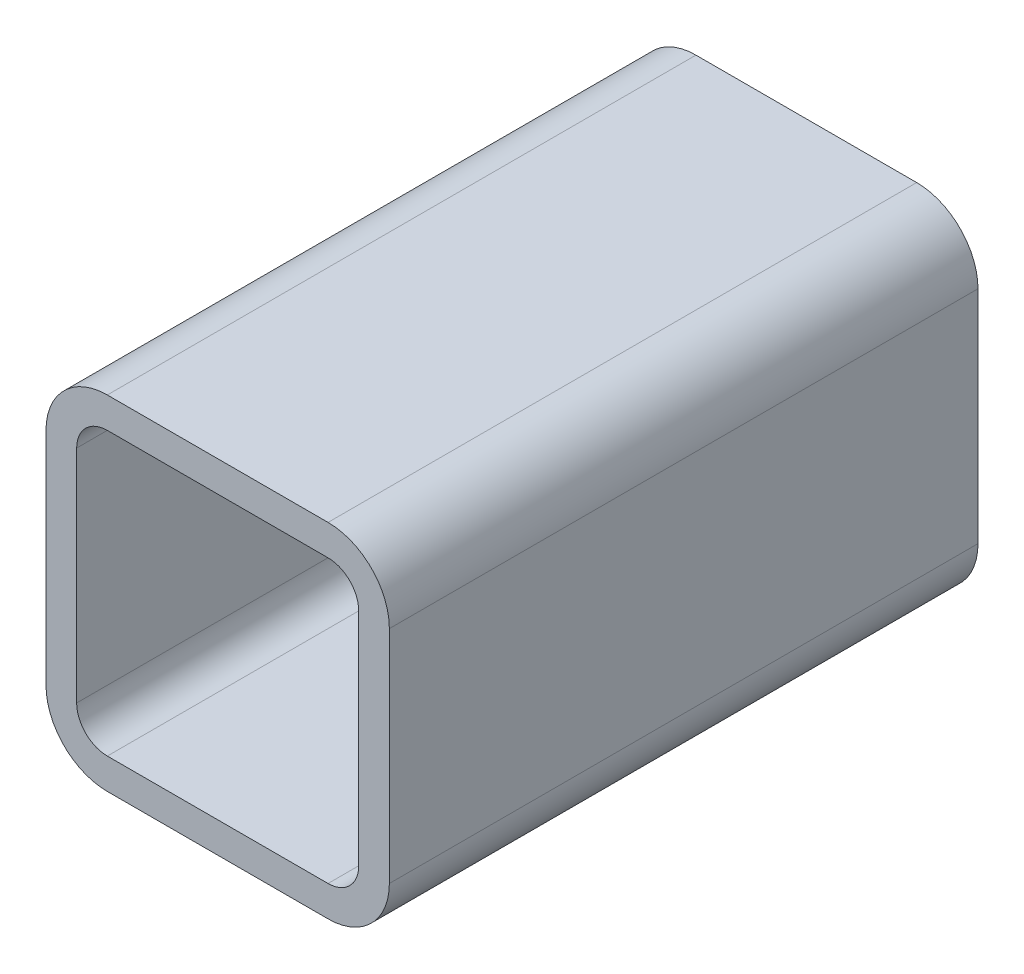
ISO-10303-21;
HEADER;
FILE_DESCRIPTION(('STEP AP214'),'2;1');
FILE_NAME('part.step','',(''),(''),'','','');
FILE_SCHEMA(('AUTOMOTIVE_DESIGN { 1 0 10303 214 1 1 1 1 }'));
ENDSEC;
DATA;
#1=APPLICATION_CONTEXT('core data for automotive mechanical design processes');
#2=APPLICATION_PROTOCOL_DEFINITION('international standard','automotive_design',2000,#1);
#3=PRODUCT_CONTEXT('',#1,'mechanical');
#4=PRODUCT('Part','Part','',(#3));
#5=PRODUCT_RELATED_PRODUCT_CATEGORY('part','',(#4));
#6=PRODUCT_DEFINITION_FORMATION('','',#4);
#7=PRODUCT_DEFINITION_CONTEXT('part definition',#1,'design');
#8=PRODUCT_DEFINITION('design','',#6,#7);
#9=PRODUCT_DEFINITION_SHAPE('','',#8);
#10=(LENGTH_UNIT() NAMED_UNIT(*) SI_UNIT(.MILLI.,.METRE.));
#11=(NAMED_UNIT(*) PLANE_ANGLE_UNIT() SI_UNIT($,.RADIAN.));
#12=(NAMED_UNIT(*) SI_UNIT($,.STERADIAN.) SOLID_ANGLE_UNIT());
#13=UNCERTAINTY_MEASURE_WITH_UNIT(LENGTH_MEASURE(1.E-05),#10,'distance_accuracy_value','');
#14=(GEOMETRIC_REPRESENTATION_CONTEXT(3) GLOBAL_UNCERTAINTY_ASSIGNED_CONTEXT((#13)) GLOBAL_UNIT_ASSIGNED_CONTEXT((#10,
#11,#12)) REPRESENTATION_CONTEXT('',''));
#15=CARTESIAN_POINT('',(0.,0.,0.));
#16=DIRECTION('',(0.,0.,1.));
#17=DIRECTION('',(1.,0.,0.));
#18=AXIS2_PLACEMENT_3D('',#15,#16,#17);
#19=CARTESIAN_POINT('',(33.9548786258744,148.039039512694,304.8));
#20=DIRECTION('',(0.,0.,1.));
#21=DIRECTION('',(1.,0.,0.));
#22=AXIS2_PLACEMENT_3D('',#19,#20,#21);
#23=PLANE('',#22);
#24=CARTESIAN_POINT('',(33.9548786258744,148.039039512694,304.8));
#25=DIRECTION('',(0.,0.,1.));
#26=DIRECTION('',(1.,0.,0.));
#27=AXIS2_PLACEMENT_3D('',#24,#25,#26);
#28=CIRCLE('',#27,31.75);
#29=CARTESIAN_POINT('',(33.9548786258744,179.789039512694,304.8));
#30=VERTEX_POINT('',#29);
#31=CARTESIAN_POINT('',(2.20487862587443,148.039039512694,304.8));
#32=VERTEX_POINT('',#31);
#33=EDGE_CURVE('E211',#30,#32,#28,.T.);
#34=ORIENTED_EDGE('',*,*,#33,.T.);
#35=DIRECTION('',(0.,-1.,0.));
#36=VECTOR('',#35,1.);
#37=CARTESIAN_POINT('',(2.20487862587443,33.7390395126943,304.8));
#38=LINE('',#37,#36);
#39=CARTESIAN_POINT('',(2.20487862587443,33.7390395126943,304.8));
#40=VERTEX_POINT('',#39);
#41=EDGE_CURVE('E214',#32,#40,#38,.T.);
#42=ORIENTED_EDGE('',*,*,#41,.T.);
#43=CARTESIAN_POINT('',(33.9548786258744,33.7390395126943,304.8));
#44=DIRECTION('',(0.,0.,1.));
#45=DIRECTION('',(1.,0.,0.));
#46=AXIS2_PLACEMENT_3D('',#43,#44,#45);
#47=CIRCLE('',#46,31.75);
#48=CARTESIAN_POINT('',(33.9548786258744,1.98903951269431,304.8));
#49=VERTEX_POINT('',#48);
#50=EDGE_CURVE('E217',#40,#49,#47,.T.);
#51=ORIENTED_EDGE('',*,*,#50,.T.);
#52=DIRECTION('',(1.,0.,0.));
#53=VECTOR('',#52,1.);
#54=CARTESIAN_POINT('',(148.254878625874,1.98903951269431,304.8));
#55=LINE('',#54,#53);
#56=CARTESIAN_POINT('',(148.254878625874,1.9890395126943,304.8));
#57=VERTEX_POINT('',#56);
#58=EDGE_CURVE('E219',#49,#57,#55,.T.);
#59=ORIENTED_EDGE('',*,*,#58,.T.);
#60=CARTESIAN_POINT('',(148.254878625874,33.7390395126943,304.8));
#61=DIRECTION('',(0.,0.,1.));
#62=DIRECTION('',(1.,0.,0.));
#63=AXIS2_PLACEMENT_3D('',#60,#61,#62);
#64=CIRCLE('',#63,31.75);
#65=CARTESIAN_POINT('',(180.004878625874,33.7390395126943,304.8));
#66=VERTEX_POINT('',#65);
#67=EDGE_CURVE('E221',#57,#66,#64,.T.);
#68=ORIENTED_EDGE('',*,*,#67,.T.);
#69=DIRECTION('',(0.,1.,0.));
#70=VECTOR('',#69,1.);
#71=CARTESIAN_POINT('',(180.004878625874,148.039039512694,304.8));
#72=LINE('',#71,#70);
#73=CARTESIAN_POINT('',(180.004878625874,148.039039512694,304.8));
#74=VERTEX_POINT('',#73);
#75=EDGE_CURVE('E223',#66,#74,#72,.T.);
#76=ORIENTED_EDGE('',*,*,#75,.T.);
#77=CARTESIAN_POINT('',(148.254878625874,148.039039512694,304.8));
#78=DIRECTION('',(0.,0.,1.));
#79=DIRECTION('',(1.,0.,0.));
#80=AXIS2_PLACEMENT_3D('',#77,#78,#79);
#81=CIRCLE('',#80,31.75);
#82=CARTESIAN_POINT('',(148.254878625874,179.789039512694,304.8));
#83=VERTEX_POINT('',#82);
#84=EDGE_CURVE('E225',#74,#83,#81,.T.);
#85=ORIENTED_EDGE('',*,*,#84,.T.);
#86=DIRECTION('',(-1.,0.,0.));
#87=VECTOR('',#86,1.);
#88=CARTESIAN_POINT('',(33.9548786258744,179.789039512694,304.8));
#89=LINE('',#88,#87);
#90=EDGE_CURVE('E227',#83,#30,#89,.T.);
#91=ORIENTED_EDGE('',*,*,#90,.T.);
#92=EDGE_LOOP('',(#34,#42,#51,#59,#68,#76,#85,#91));
#93=FACE_BOUND('',#92,.T.);
#94=DIRECTION('',(0.,-1.,0.));
#95=VECTOR('',#94,1.);
#96=CARTESIAN_POINT('',(18.0798786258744,33.7390395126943,304.8));
#97=LINE('',#96,#95);
#98=CARTESIAN_POINT('',(18.0798786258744,148.039039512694,304.8));
#99=VERTEX_POINT('',#98);
#100=CARTESIAN_POINT('',(18.0798786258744,33.7390395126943,304.8));
#101=VERTEX_POINT('',#100);
#102=EDGE_CURVE('E154',#99,#101,#97,.T.);
#103=ORIENTED_EDGE('',*,*,#102,.F.);
#104=CARTESIAN_POINT('',(33.9548786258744,148.039039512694,304.8));
#105=DIRECTION('',(0.,0.,1.));
#106=DIRECTION('',(1.,0.,0.));
#107=AXIS2_PLACEMENT_3D('',#104,#105,#106);
#108=CIRCLE('',#107,15.875);
#109=CARTESIAN_POINT('',(33.9548786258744,163.914039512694,304.8));
#110=VERTEX_POINT('',#109);
#111=EDGE_CURVE('E146',#110,#99,#108,.T.);
#112=ORIENTED_EDGE('',*,*,#111,.F.);
#113=DIRECTION('',(-1.,0.,0.));
#114=VECTOR('',#113,1.);
#115=CARTESIAN_POINT('',(33.9548786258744,163.914039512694,304.8));
#116=LINE('',#115,#114);
#117=CARTESIAN_POINT('',(148.254878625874,163.914039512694,304.8));
#118=VERTEX_POINT('',#117);
#119=EDGE_CURVE('E179',#118,#110,#116,.T.);
#120=ORIENTED_EDGE('',*,*,#119,.F.);
#121=CARTESIAN_POINT('',(148.254878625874,148.039039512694,304.8));
#122=DIRECTION('',(0.,0.,1.));
#123=DIRECTION('',(1.,0.,0.));
#124=AXIS2_PLACEMENT_3D('',#121,#122,#123);
#125=CIRCLE('',#124,15.875);
#126=CARTESIAN_POINT('',(164.129878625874,148.039039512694,304.8));
#127=VERTEX_POINT('',#126);
#128=EDGE_CURVE('E177',#127,#118,#125,.T.);
#129=ORIENTED_EDGE('',*,*,#128,.F.);
#130=DIRECTION('',(0.,1.,0.));
#131=VECTOR('',#130,1.);
#132=CARTESIAN_POINT('',(164.129878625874,148.039039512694,304.8));
#133=LINE('',#132,#131);
#134=CARTESIAN_POINT('',(164.129878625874,33.7390395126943,304.8));
#135=VERTEX_POINT('',#134);
#136=EDGE_CURVE('E175',#135,#127,#133,.T.);
#137=ORIENTED_EDGE('',*,*,#136,.F.);
#138=CARTESIAN_POINT('',(148.254878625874,33.7390395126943,304.8));
#139=DIRECTION('',(0.,0.,1.));
#140=DIRECTION('',(1.,0.,0.));
#141=AXIS2_PLACEMENT_3D('',#138,#139,#140);
#142=CIRCLE('',#141,15.875);
#143=CARTESIAN_POINT('',(148.254878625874,17.8640395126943,304.8));
#144=VERTEX_POINT('',#143);
#145=EDGE_CURVE('E173',#144,#135,#142,.T.);
#146=ORIENTED_EDGE('',*,*,#145,.F.);
#147=DIRECTION('',(1.,0.,0.));
#148=VECTOR('',#147,1.);
#149=CARTESIAN_POINT('',(148.254878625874,17.8640395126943,304.8));
#150=LINE('',#149,#148);
#151=CARTESIAN_POINT('',(33.9548786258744,17.8640395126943,304.8));
#152=VERTEX_POINT('',#151);
#153=EDGE_CURVE('E169',#152,#144,#150,.T.);
#154=ORIENTED_EDGE('',*,*,#153,.F.);
#155=CARTESIAN_POINT('',(33.9548786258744,33.7390395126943,304.8));
#156=DIRECTION('',(0.,0.,1.));
#157=DIRECTION('',(1.,0.,0.));
#158=AXIS2_PLACEMENT_3D('',#155,#156,#157);
#159=CIRCLE('',#158,15.875);
#160=EDGE_CURVE('E167',#101,#152,#159,.T.);
#161=ORIENTED_EDGE('',*,*,#160,.F.);
#162=EDGE_LOOP('',(#103,#112,#120,#129,#137,#146,#154,#161));
#163=FACE_BOUND('',#162,.T.);
#164=ADVANCED_FACE('F33',(#93,#163),#23,.T.);
#165=CARTESIAN_POINT('',(33.9548786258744,148.039039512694,0.));
#166=DIRECTION('',(0.,0.,1.));
#167=DIRECTION('',(1.,0.,0.));
#168=AXIS2_PLACEMENT_3D('',#165,#166,#167);
#169=PLANE('',#168);
#170=CARTESIAN_POINT('',(33.9548786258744,148.039039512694,0.));
#171=DIRECTION('',(0.,0.,1.));
#172=DIRECTION('',(1.,0.,0.));
#173=AXIS2_PLACEMENT_3D('',#170,#171,#172);
#174=CIRCLE('',#173,31.75);
#175=CARTESIAN_POINT('',(33.9548786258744,179.789039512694,0.));
#176=VERTEX_POINT('',#175);
#177=CARTESIAN_POINT('',(2.20487862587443,148.039039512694,0.));
#178=VERTEX_POINT('',#177);
#179=EDGE_CURVE('E162',#176,#178,#174,.T.);
#180=ORIENTED_EDGE('',*,*,#179,.F.);
#181=DIRECTION('',(-1.,0.,0.));
#182=VECTOR('',#181,1.);
#183=CARTESIAN_POINT('',(33.9548786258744,179.789039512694,0.));
#184=LINE('',#183,#182);
#185=CARTESIAN_POINT('',(148.254878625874,179.789039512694,0.));
#186=VERTEX_POINT('',#185);
#187=EDGE_CURVE('E215',#186,#176,#184,.T.);
#188=ORIENTED_EDGE('',*,*,#187,.F.);
#189=CARTESIAN_POINT('',(148.254878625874,148.039039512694,0.));
#190=DIRECTION('',(0.,0.,1.));
#191=DIRECTION('',(1.,0.,0.));
#192=AXIS2_PLACEMENT_3D('',#189,#190,#191);
#193=CIRCLE('',#192,31.75);
#194=CARTESIAN_POINT('',(180.004878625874,148.039039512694,0.));
#195=VERTEX_POINT('',#194);
#196=EDGE_CURVE('E242',#195,#186,#193,.T.);
#197=ORIENTED_EDGE('',*,*,#196,.F.);
#198=DIRECTION('',(0.,1.,0.));
#199=VECTOR('',#198,1.);
#200=CARTESIAN_POINT('',(180.004878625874,148.039039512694,0.));
#201=LINE('',#200,#199);
#202=CARTESIAN_POINT('',(180.004878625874,33.7390395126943,0.));
#203=VERTEX_POINT('',#202);
#204=EDGE_CURVE('E240',#203,#195,#201,.T.);
#205=ORIENTED_EDGE('',*,*,#204,.F.);
#206=CARTESIAN_POINT('',(148.254878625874,33.7390395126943,0.));
#207=DIRECTION('',(0.,0.,1.));
#208=DIRECTION('',(1.,0.,0.));
#209=AXIS2_PLACEMENT_3D('',#206,#207,#208);
#210=CIRCLE('',#209,31.75);
#211=CARTESIAN_POINT('',(148.254878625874,1.9890395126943,0.));
#212=VERTEX_POINT('',#211);
#213=EDGE_CURVE('E238',#212,#203,#210,.T.);
#214=ORIENTED_EDGE('',*,*,#213,.F.);
#215=DIRECTION('',(1.,0.,0.));
#216=VECTOR('',#215,1.);
#217=CARTESIAN_POINT('',(148.254878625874,1.98903951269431,0.));
#218=LINE('',#217,#216);
#219=CARTESIAN_POINT('',(33.9548786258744,1.98903951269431,0.));
#220=VERTEX_POINT('',#219);
#221=EDGE_CURVE('E236',#220,#212,#218,.T.);
#222=ORIENTED_EDGE('',*,*,#221,.F.);
#223=CARTESIAN_POINT('',(33.9548786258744,33.7390395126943,0.));
#224=DIRECTION('',(0.,0.,1.));
#225=DIRECTION('',(1.,0.,0.));
#226=AXIS2_PLACEMENT_3D('',#223,#224,#225);
#227=CIRCLE('',#226,31.75);
#228=CARTESIAN_POINT('',(2.20487862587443,33.7390395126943,0.));
#229=VERTEX_POINT('',#228);
#230=EDGE_CURVE('E234',#229,#220,#227,.T.);
#231=ORIENTED_EDGE('',*,*,#230,.F.);
#232=DIRECTION('',(0.,-1.,0.));
#233=VECTOR('',#232,1.);
#234=CARTESIAN_POINT('',(2.20487862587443,33.7390395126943,0.));
#235=LINE('',#234,#233);
#236=EDGE_CURVE('E232',#178,#229,#235,.T.);
#237=ORIENTED_EDGE('',*,*,#236,.F.);
#238=EDGE_LOOP('',(#180,#188,#197,#205,#214,#222,#231,#237));
#239=FACE_BOUND('',#238,.T.);
#240=CARTESIAN_POINT('',(33.9548786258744,148.039039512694,0.));
#241=DIRECTION('',(0.,0.,1.));
#242=DIRECTION('',(1.,0.,0.));
#243=AXIS2_PLACEMENT_3D('',#240,#241,#242);
#244=CIRCLE('',#243,15.875);
#245=CARTESIAN_POINT('',(33.9548786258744,163.914039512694,0.));
#246=VERTEX_POINT('',#245);
#247=CARTESIAN_POINT('',(18.0798786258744,148.039039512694,0.));
#248=VERTEX_POINT('',#247);
#249=EDGE_CURVE('E56',#246,#248,#244,.T.);
#250=ORIENTED_EDGE('',*,*,#249,.T.);
#251=DIRECTION('',(0.,-1.,0.));
#252=VECTOR('',#251,1.);
#253=CARTESIAN_POINT('',(18.0798786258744,33.7390395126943,0.));
#254=LINE('',#253,#252);
#255=CARTESIAN_POINT('',(18.0798786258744,33.7390395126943,0.));
#256=VERTEX_POINT('',#255);
#257=EDGE_CURVE('E161',#248,#256,#254,.T.);
#258=ORIENTED_EDGE('',*,*,#257,.T.);
#259=CARTESIAN_POINT('',(33.9548786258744,33.7390395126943,0.));
#260=DIRECTION('',(0.,0.,1.));
#261=DIRECTION('',(1.,0.,0.));
#262=AXIS2_PLACEMENT_3D('',#259,#260,#261);
#263=CIRCLE('',#262,15.875);
#264=CARTESIAN_POINT('',(33.9548786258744,17.8640395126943,0.));
#265=VERTEX_POINT('',#264);
#266=EDGE_CURVE('E183',#256,#265,#263,.T.);
#267=ORIENTED_EDGE('',*,*,#266,.T.);
#268=DIRECTION('',(1.,0.,0.));
#269=VECTOR('',#268,1.);
#270=CARTESIAN_POINT('',(148.254878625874,17.8640395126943,0.));
#271=LINE('',#270,#269);
#272=CARTESIAN_POINT('',(148.254878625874,17.8640395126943,0.));
#273=VERTEX_POINT('',#272);
#274=EDGE_CURVE('E186',#265,#273,#271,.T.);
#275=ORIENTED_EDGE('',*,*,#274,.T.);
#276=CARTESIAN_POINT('',(148.254878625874,33.7390395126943,0.));
#277=DIRECTION('',(0.,0.,1.));
#278=DIRECTION('',(1.,0.,0.));
#279=AXIS2_PLACEMENT_3D('',#276,#277,#278);
#280=CIRCLE('',#279,15.875);
#281=CARTESIAN_POINT('',(164.129878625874,33.7390395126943,0.));
#282=VERTEX_POINT('',#281);
#283=EDGE_CURVE('E189',#273,#282,#280,.T.);
#284=ORIENTED_EDGE('',*,*,#283,.T.);
#285=DIRECTION('',(0.,1.,0.));
#286=VECTOR('',#285,1.);
#287=CARTESIAN_POINT('',(164.129878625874,148.039039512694,0.));
#288=LINE('',#287,#286);
#289=CARTESIAN_POINT('',(164.129878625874,148.039039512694,0.));
#290=VERTEX_POINT('',#289);
#291=EDGE_CURVE('E192',#282,#290,#288,.T.);
#292=ORIENTED_EDGE('',*,*,#291,.T.);
#293=CARTESIAN_POINT('',(148.254878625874,148.039039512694,0.));
#294=DIRECTION('',(0.,0.,1.));
#295=DIRECTION('',(1.,0.,0.));
#296=AXIS2_PLACEMENT_3D('',#293,#294,#295);
#297=CIRCLE('',#296,15.875);
#298=CARTESIAN_POINT('',(148.254878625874,163.914039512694,0.));
#299=VERTEX_POINT('',#298);
#300=EDGE_CURVE('E195',#290,#299,#297,.T.);
#301=ORIENTED_EDGE('',*,*,#300,.T.);
#302=DIRECTION('',(-1.,0.,0.));
#303=VECTOR('',#302,1.);
#304=CARTESIAN_POINT('',(33.9548786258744,163.914039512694,0.));
#305=LINE('',#304,#303);
#306=EDGE_CURVE('E155',#299,#246,#305,.T.);
#307=ORIENTED_EDGE('',*,*,#306,.T.);
#308=EDGE_LOOP('',(#250,#258,#267,#275,#284,#292,#301,#307));
#309=FACE_BOUND('',#308,.T.);
#310=ADVANCED_FACE('F272',(#239,#309),#169,.F.);
#311=CARTESIAN_POINT('',(33.9548786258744,148.039039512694,304.8));
#312=DIRECTION('',(0.,0.,-1.));
#313=DIRECTION('',(-1.,0.,0.));
#314=AXIS2_PLACEMENT_3D('',#311,#312,#313);
#315=CYLINDRICAL_SURFACE('',#314,31.75);
#316=ORIENTED_EDGE('',*,*,#179,.T.);
#317=DIRECTION('',(0.,0.,-1.));
#318=VECTOR('',#317,1.);
#319=CARTESIAN_POINT('',(2.20487862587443,148.039039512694,304.8));
#320=LINE('',#319,#318);
#321=EDGE_CURVE('E11',#32,#178,#320,.T.);
#322=ORIENTED_EDGE('',*,*,#321,.F.);
#323=ORIENTED_EDGE('',*,*,#33,.F.);
#324=DIRECTION('',(0.,0.,-1.));
#325=VECTOR('',#324,1.);
#326=CARTESIAN_POINT('',(33.9548786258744,179.789039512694,304.8));
#327=LINE('',#326,#325);
#328=EDGE_CURVE('E229',#30,#176,#327,.T.);
#329=ORIENTED_EDGE('',*,*,#328,.T.);
#330=EDGE_LOOP('',(#316,#322,#323,#329));
#331=FACE_BOUND('',#330,.T.);
#332=ADVANCED_FACE('F35',(#331),#315,.T.);
#333=CARTESIAN_POINT('',(2.20487862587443,33.7390395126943,304.8));
#334=DIRECTION('',(1.,0.,0.));
#335=DIRECTION('',(0.,0.,-1.));
#336=AXIS2_PLACEMENT_3D('',#333,#334,#335);
#337=PLANE('',#336);
#338=ORIENTED_EDGE('',*,*,#236,.T.);
#339=DIRECTION('',(0.,0.,-1.));
#340=VECTOR('',#339,1.);
#341=CARTESIAN_POINT('',(2.20487862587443,33.7390395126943,304.8));
#342=LINE('',#341,#340);
#343=EDGE_CURVE('E41',#40,#229,#342,.T.);
#344=ORIENTED_EDGE('',*,*,#343,.F.);
#345=ORIENTED_EDGE('',*,*,#41,.F.);
#346=ORIENTED_EDGE('',*,*,#321,.T.);
#347=EDGE_LOOP('',(#338,#344,#345,#346));
#348=FACE_BOUND('',#347,.T.);
#349=ADVANCED_FACE('F289',(#348),#337,.F.);
#350=CARTESIAN_POINT('',(33.9548786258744,33.7390395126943,304.8));
#351=DIRECTION('',(0.,0.,-1.));
#352=DIRECTION('',(-1.,0.,0.));
#353=AXIS2_PLACEMENT_3D('',#350,#351,#352);
#354=CYLINDRICAL_SURFACE('',#353,31.75);
#355=ORIENTED_EDGE('',*,*,#230,.T.);
#356=DIRECTION('',(0.,0.,-1.));
#357=VECTOR('',#356,1.);
#358=CARTESIAN_POINT('',(33.9548786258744,1.98903951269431,304.8));
#359=LINE('',#358,#357);
#360=EDGE_CURVE('E259',#49,#220,#359,.T.);
#361=ORIENTED_EDGE('',*,*,#360,.F.);
#362=ORIENTED_EDGE('',*,*,#50,.F.);
#363=ORIENTED_EDGE('',*,*,#343,.T.);
#364=EDGE_LOOP('',(#355,#361,#362,#363));
#365=FACE_BOUND('',#364,.T.);
#366=ADVANCED_FACE('F266',(#365),#354,.T.);
#367=CARTESIAN_POINT('',(148.254878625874,1.98903951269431,304.8));
#368=DIRECTION('',(0.,1.,0.));
#369=DIRECTION('',(0.,0.,1.));
#370=AXIS2_PLACEMENT_3D('',#367,#368,#369);
#371=PLANE('',#370);
#372=ORIENTED_EDGE('',*,*,#221,.T.);
#373=DIRECTION('',(0.,0.,-1.));
#374=VECTOR('',#373,1.);
#375=CARTESIAN_POINT('',(148.254878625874,1.9890395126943,304.8));
#376=LINE('',#375,#374);
#377=EDGE_CURVE('E256',#57,#212,#376,.T.);
#378=ORIENTED_EDGE('',*,*,#377,.F.);
#379=ORIENTED_EDGE('',*,*,#58,.F.);
#380=ORIENTED_EDGE('',*,*,#360,.T.);
#381=EDGE_LOOP('',(#372,#378,#379,#380));
#382=FACE_BOUND('',#381,.T.);
#383=ADVANCED_FACE('F278',(#382),#371,.F.);
#384=CARTESIAN_POINT('',(148.254878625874,33.7390395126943,304.8));
#385=DIRECTION('',(0.,0.,-1.));
#386=DIRECTION('',(-1.,0.,0.));
#387=AXIS2_PLACEMENT_3D('',#384,#385,#386);
#388=CYLINDRICAL_SURFACE('',#387,31.75);
#389=ORIENTED_EDGE('',*,*,#213,.T.);
#390=DIRECTION('',(0.,0.,-1.));
#391=VECTOR('',#390,1.);
#392=CARTESIAN_POINT('',(180.004878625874,33.7390395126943,304.8));
#393=LINE('',#392,#391);
#394=EDGE_CURVE('E253',#66,#203,#393,.T.);
#395=ORIENTED_EDGE('',*,*,#394,.F.);
#396=ORIENTED_EDGE('',*,*,#67,.F.);
#397=ORIENTED_EDGE('',*,*,#377,.T.);
#398=EDGE_LOOP('',(#389,#395,#396,#397));
#399=FACE_BOUND('',#398,.T.);
#400=ADVANCED_FACE('F282',(#399),#388,.T.);
#401=CARTESIAN_POINT('',(180.004878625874,148.039039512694,304.8));
#402=DIRECTION('',(-1.,0.,0.));
#403=DIRECTION('',(0.,0.,1.));
#404=AXIS2_PLACEMENT_3D('',#401,#402,#403);
#405=PLANE('',#404);
#406=ORIENTED_EDGE('',*,*,#204,.T.);
#407=DIRECTION('',(0.,0.,-1.));
#408=VECTOR('',#407,1.);
#409=CARTESIAN_POINT('',(180.004878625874,148.039039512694,304.8));
#410=LINE('',#409,#408);
#411=EDGE_CURVE('E250',#74,#195,#410,.T.);
#412=ORIENTED_EDGE('',*,*,#411,.F.);
#413=ORIENTED_EDGE('',*,*,#75,.F.);
#414=ORIENTED_EDGE('',*,*,#394,.T.);
#415=EDGE_LOOP('',(#406,#412,#413,#414));
#416=FACE_BOUND('',#415,.T.);
#417=ADVANCED_FACE('F302',(#416),#405,.F.);
#418=CARTESIAN_POINT('',(148.254878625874,148.039039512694,304.8));
#419=DIRECTION('',(0.,0.,-1.));
#420=DIRECTION('',(-1.,0.,0.));
#421=AXIS2_PLACEMENT_3D('',#418,#419,#420);
#422=CYLINDRICAL_SURFACE('',#421,31.75);
#423=ORIENTED_EDGE('',*,*,#196,.T.);
#424=DIRECTION('',(0.,0.,-1.));
#425=VECTOR('',#424,1.);
#426=CARTESIAN_POINT('',(148.254878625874,179.789039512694,304.8));
#427=LINE('',#426,#425);
#428=EDGE_CURVE('E247',#83,#186,#427,.T.);
#429=ORIENTED_EDGE('',*,*,#428,.F.);
#430=ORIENTED_EDGE('',*,*,#84,.F.);
#431=ORIENTED_EDGE('',*,*,#411,.T.);
#432=EDGE_LOOP('',(#423,#429,#430,#431));
#433=FACE_BOUND('',#432,.T.);
#434=ADVANCED_FACE('F300',(#433),#422,.T.);
#435=CARTESIAN_POINT('',(33.9548786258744,179.789039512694,304.8));
#436=DIRECTION('',(0.,-1.,0.));
#437=DIRECTION('',(0.,0.,-1.));
#438=AXIS2_PLACEMENT_3D('',#435,#436,#437);
#439=PLANE('',#438);
#440=ORIENTED_EDGE('',*,*,#187,.T.);
#441=ORIENTED_EDGE('',*,*,#328,.F.);
#442=ORIENTED_EDGE('',*,*,#90,.F.);
#443=ORIENTED_EDGE('',*,*,#428,.T.);
#444=EDGE_LOOP('',(#440,#441,#442,#443));
#445=FACE_BOUND('',#444,.T.);
#446=ADVANCED_FACE('F295',(#445),#439,.F.);
#447=CARTESIAN_POINT('',(33.9548786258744,148.039039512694,304.8));
#448=DIRECTION('',(0.,0.,-1.));
#449=DIRECTION('',(-1.,0.,0.));
#450=AXIS2_PLACEMENT_3D('',#447,#448,#449);
#451=CYLINDRICAL_SURFACE('',#450,15.875);
#452=ORIENTED_EDGE('',*,*,#249,.F.);
#453=DIRECTION('',(0.,0.,-1.));
#454=VECTOR('',#453,1.);
#455=CARTESIAN_POINT('',(33.9548786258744,163.914039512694,304.8));
#456=LINE('',#455,#454);
#457=EDGE_CURVE('E150',#110,#246,#456,.T.);
#458=ORIENTED_EDGE('',*,*,#457,.F.);
#459=ORIENTED_EDGE('',*,*,#111,.T.);
#460=DIRECTION('',(0.,0.,-1.));
#461=VECTOR('',#460,1.);
#462=CARTESIAN_POINT('',(18.0798786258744,148.039039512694,304.8));
#463=LINE('',#462,#461);
#464=EDGE_CURVE('E149',#99,#248,#463,.T.);
#465=ORIENTED_EDGE('',*,*,#464,.T.);
#466=EDGE_LOOP('',(#452,#458,#459,#465));
#467=FACE_BOUND('',#466,.T.);
#468=ADVANCED_FACE('F148',(#467),#451,.F.);
#469=CARTESIAN_POINT('',(18.0798786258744,33.7390395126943,304.8));
#470=DIRECTION('',(1.,0.,0.));
#471=DIRECTION('',(0.,0.,-1.));
#472=AXIS2_PLACEMENT_3D('',#469,#470,#471);
#473=PLANE('',#472);
#474=ORIENTED_EDGE('',*,*,#257,.F.);
#475=ORIENTED_EDGE('',*,*,#464,.F.);
#476=ORIENTED_EDGE('',*,*,#102,.T.);
#477=DIRECTION('',(0.,0.,-1.));
#478=VECTOR('',#477,1.);
#479=CARTESIAN_POINT('',(18.0798786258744,33.7390395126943,304.8));
#480=LINE('',#479,#478);
#481=EDGE_CURVE('E163',#101,#256,#480,.T.);
#482=ORIENTED_EDGE('',*,*,#481,.T.);
#483=EDGE_LOOP('',(#474,#475,#476,#482));
#484=FACE_BOUND('',#483,.T.);
#485=ADVANCED_FACE('F158',(#484),#473,.T.);
#486=CARTESIAN_POINT('',(33.9548786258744,33.7390395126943,304.8));
#487=DIRECTION('',(0.,0.,-1.));
#488=DIRECTION('',(-1.,0.,0.));
#489=AXIS2_PLACEMENT_3D('',#486,#487,#488);
#490=CYLINDRICAL_SURFACE('',#489,15.875);
#491=ORIENTED_EDGE('',*,*,#266,.F.);
#492=ORIENTED_EDGE('',*,*,#481,.F.);
#493=ORIENTED_EDGE('',*,*,#160,.T.);
#494=DIRECTION('',(0.,0.,-1.));
#495=VECTOR('',#494,1.);
#496=CARTESIAN_POINT('',(33.9548786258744,17.8640395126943,304.8));
#497=LINE('',#496,#495);
#498=EDGE_CURVE('E208',#152,#265,#497,.T.);
#499=ORIENTED_EDGE('',*,*,#498,.T.);
#500=EDGE_LOOP('',(#491,#492,#493,#499));
#501=FACE_BOUND('',#500,.T.);
#502=ADVANCED_FACE('F327',(#501),#490,.F.);
#503=CARTESIAN_POINT('',(148.254878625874,17.8640395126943,304.8));
#504=DIRECTION('',(0.,1.,0.));
#505=DIRECTION('',(0.,0.,1.));
#506=AXIS2_PLACEMENT_3D('',#503,#504,#505);
#507=PLANE('',#506);
#508=ORIENTED_EDGE('',*,*,#274,.F.);
#509=ORIENTED_EDGE('',*,*,#498,.F.);
#510=ORIENTED_EDGE('',*,*,#153,.T.);
#511=DIRECTION('',(0.,0.,-1.));
#512=VECTOR('',#511,1.);
#513=CARTESIAN_POINT('',(148.254878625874,17.8640395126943,304.8));
#514=LINE('',#513,#512);
#515=EDGE_CURVE('E206',#144,#273,#514,.T.);
#516=ORIENTED_EDGE('',*,*,#515,.T.);
#517=EDGE_LOOP('',(#508,#509,#510,#516));
#518=FACE_BOUND('',#517,.T.);
#519=ADVANCED_FACE('F331',(#518),#507,.T.);
#520=CARTESIAN_POINT('',(148.254878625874,33.7390395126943,304.8));
#521=DIRECTION('',(0.,0.,-1.));
#522=DIRECTION('',(-1.,0.,0.));
#523=AXIS2_PLACEMENT_3D('',#520,#521,#522);
#524=CYLINDRICAL_SURFACE('',#523,15.875);
#525=ORIENTED_EDGE('',*,*,#283,.F.);
#526=ORIENTED_EDGE('',*,*,#515,.F.);
#527=ORIENTED_EDGE('',*,*,#145,.T.);
#528=DIRECTION('',(0.,0.,-1.));
#529=VECTOR('',#528,1.);
#530=CARTESIAN_POINT('',(164.129878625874,33.7390395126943,304.8));
#531=LINE('',#530,#529);
#532=EDGE_CURVE('E204',#135,#282,#531,.T.);
#533=ORIENTED_EDGE('',*,*,#532,.T.);
#534=EDGE_LOOP('',(#525,#526,#527,#533));
#535=FACE_BOUND('',#534,.T.);
#536=ADVANCED_FACE('F337',(#535),#524,.F.);
#537=CARTESIAN_POINT('',(164.129878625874,148.039039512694,304.8));
#538=DIRECTION('',(-1.,0.,0.));
#539=DIRECTION('',(0.,0.,1.));
#540=AXIS2_PLACEMENT_3D('',#537,#538,#539);
#541=PLANE('',#540);
#542=ORIENTED_EDGE('',*,*,#291,.F.);
#543=ORIENTED_EDGE('',*,*,#532,.F.);
#544=ORIENTED_EDGE('',*,*,#136,.T.);
#545=DIRECTION('',(0.,0.,-1.));
#546=VECTOR('',#545,1.);
#547=CARTESIAN_POINT('',(164.129878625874,148.039039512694,304.8));
#548=LINE('',#547,#546);
#549=EDGE_CURVE('E202',#127,#290,#548,.T.);
#550=ORIENTED_EDGE('',*,*,#549,.T.);
#551=EDGE_LOOP('',(#542,#543,#544,#550));
#552=FACE_BOUND('',#551,.T.);
#553=ADVANCED_FACE('F341',(#552),#541,.T.);
#554=CARTESIAN_POINT('',(148.254878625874,148.039039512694,304.8));
#555=DIRECTION('',(0.,0.,-1.));
#556=DIRECTION('',(-1.,0.,0.));
#557=AXIS2_PLACEMENT_3D('',#554,#555,#556);
#558=CYLINDRICAL_SURFACE('',#557,15.875);
#559=ORIENTED_EDGE('',*,*,#300,.F.);
#560=ORIENTED_EDGE('',*,*,#549,.F.);
#561=ORIENTED_EDGE('',*,*,#128,.T.);
#562=DIRECTION('',(0.,0.,-1.));
#563=VECTOR('',#562,1.);
#564=CARTESIAN_POINT('',(148.254878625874,163.914039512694,304.8));
#565=LINE('',#564,#563);
#566=EDGE_CURVE('E48',#118,#299,#565,.T.);
#567=ORIENTED_EDGE('',*,*,#566,.T.);
#568=EDGE_LOOP('',(#559,#560,#561,#567));
#569=FACE_BOUND('',#568,.T.);
#570=ADVANCED_FACE('F345',(#569),#558,.F.);
#571=CARTESIAN_POINT('',(33.9548786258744,163.914039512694,304.8));
#572=DIRECTION('',(0.,-1.,0.));
#573=DIRECTION('',(0.,0.,-1.));
#574=AXIS2_PLACEMENT_3D('',#571,#572,#573);
#575=PLANE('',#574);
#576=ORIENTED_EDGE('',*,*,#306,.F.);
#577=ORIENTED_EDGE('',*,*,#566,.F.);
#578=ORIENTED_EDGE('',*,*,#119,.T.);
#579=ORIENTED_EDGE('',*,*,#457,.T.);
#580=EDGE_LOOP('',(#576,#577,#578,#579));
#581=FACE_BOUND('',#580,.T.);
#582=ADVANCED_FACE('F349',(#581),#575,.T.);
#583=CLOSED_SHELL('',(#164,#310,#332,#349,#366,#383,#400,#417,#434,#446,#468,#485,#502,#519,
#536,#553,#570,#582));
#584=MANIFOLD_SOLID_BREP('B2',#583);
#585=ADVANCED_BREP_SHAPE_REPRESENTATION('',(#18,#584),#14);
#586=SHAPE_DEFINITION_REPRESENTATION(#9,#585);
ENDSEC;
END-ISO-10303-21;
